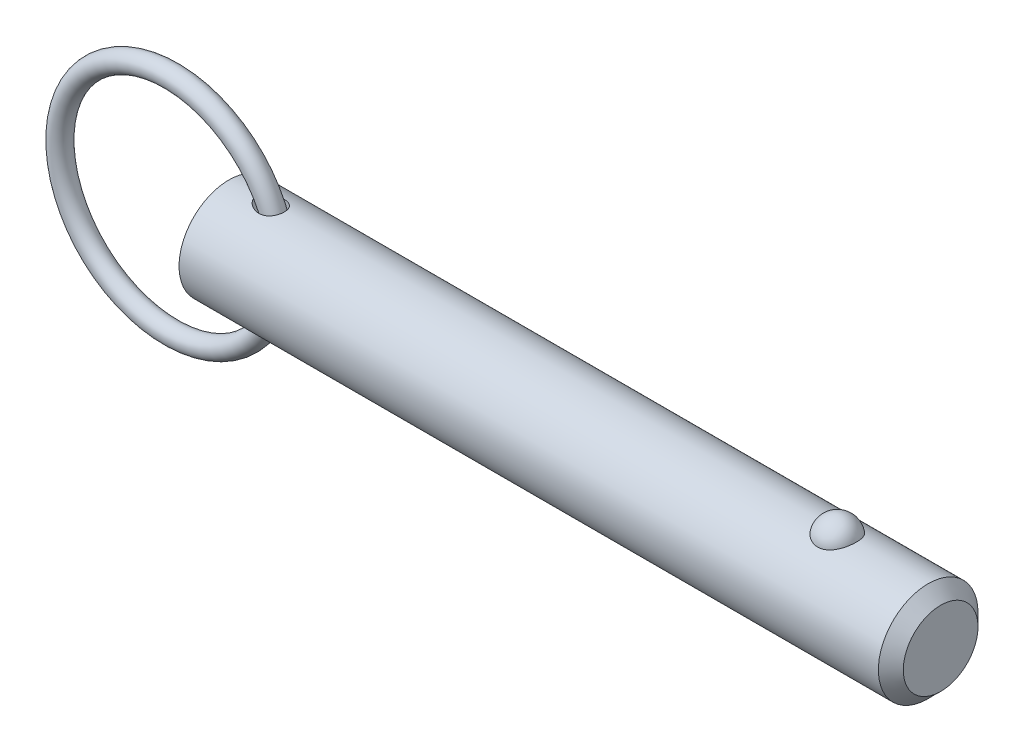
ISO-10303-21;
HEADER;
FILE_DESCRIPTION(('STEP AP214'),'2;1');
FILE_NAME('part.step','',(''),(''),'','','');
FILE_SCHEMA(('AUTOMOTIVE_DESIGN { 1 0 10303 214 1 1 1 1 }'));
ENDSEC;
DATA;
#1=APPLICATION_CONTEXT('core data for automotive mechanical design processes');
#2=APPLICATION_PROTOCOL_DEFINITION('international standard','automotive_design',2000,#1);
#3=PRODUCT_CONTEXT('',#1,'mechanical');
#4=PRODUCT('Part','Part','',(#3));
#5=PRODUCT_RELATED_PRODUCT_CATEGORY('part','',(#4));
#6=PRODUCT_DEFINITION_FORMATION('','',#4);
#7=PRODUCT_DEFINITION_CONTEXT('part definition',#1,'design');
#8=PRODUCT_DEFINITION('design','',#6,#7);
#9=PRODUCT_DEFINITION_SHAPE('','',#8);
#10=(LENGTH_UNIT() NAMED_UNIT(*) SI_UNIT(.MILLI.,.METRE.));
#11=(NAMED_UNIT(*) PLANE_ANGLE_UNIT() SI_UNIT($,.RADIAN.));
#12=(NAMED_UNIT(*) SI_UNIT($,.STERADIAN.) SOLID_ANGLE_UNIT());
#13=UNCERTAINTY_MEASURE_WITH_UNIT(LENGTH_MEASURE(1.E-05),#10,'distance_accuracy_value','');
#14=(GEOMETRIC_REPRESENTATION_CONTEXT(3) GLOBAL_UNCERTAINTY_ASSIGNED_CONTEXT((#13)) GLOBAL_UNIT_ASSIGNED_CONTEXT((#10,
#11,#12)) REPRESENTATION_CONTEXT('',''));
#15=CARTESIAN_POINT('',(0.,0.,0.));
#16=DIRECTION('',(0.,0.,1.));
#17=DIRECTION('',(1.,0.,0.));
#18=AXIS2_PLACEMENT_3D('',#15,#16,#17);
#19=CARTESIAN_POINT('',(-8.23730968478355,0.,0.));
#20=DIRECTION('',(0.,0.,1.));
#21=DIRECTION('',(1.,0.,0.));
#22=AXIS2_PLACEMENT_3D('',#19,#20,#21);
#23=TOROIDAL_SURFACE('',#22,15.875,1.422);
#24=CARTESIAN_POINT('',(9.05969031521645,0.,0.));
#25=VERTEX_POINT('',#24);
#26=VERTEX_LOOP('',#25);
#27=FACE_BOUND('',#26,.T.);
#28=ADVANCED_FACE('P0_F12',(#27),#23,.T.);
#29=CLOSED_SHELL('',(#28));
#30=MANIFOLD_SOLID_BREP('P0_B1',#29);
#31=CARTESIAN_POINT('',(0.,0.,0.));
#32=DIRECTION('',(1.,0.,0.));
#33=DIRECTION('',(0.,0.,-1.));
#34=AXIS2_PLACEMENT_3D('',#31,#32,#33);
#35=CYLINDRICAL_SURFACE('',#34,7.11);
#36=CARTESIAN_POINT('',(3.98467340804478,7.10072679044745,-0.363013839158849));
#37=CARTESIAN_POINT('',(4.00971652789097,7.09600153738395,-0.45539194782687));
#38=CARTESIAN_POINT('',(4.04401947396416,7.08958406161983,-0.545230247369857));
#39=CARTESIAN_POINT('',(4.12810160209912,7.07427055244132,-0.717157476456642));
#40=CARTESIAN_POINT('',(4.17791765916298,7.06536861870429,-0.799227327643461));
#41=CARTESIAN_POINT('',(4.28924471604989,7.04620300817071,-0.953469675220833));
#42=CARTESIAN_POINT('',(4.35063580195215,7.035953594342,-1.02573162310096));
#43=CARTESIAN_POINT('',(4.48282610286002,7.01493313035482,-1.16081412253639));
#44=CARTESIAN_POINT('',(4.55362244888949,7.00416223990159,-1.22363754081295));
#45=CARTESIAN_POINT('',(4.71659336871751,6.98090398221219,-1.35055080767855));
#46=CARTESIAN_POINT('',(4.81029272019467,6.96847103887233,-1.41269256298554));
#47=CARTESIAN_POINT('',(5.0057240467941,6.94515366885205,-1.52319699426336));
#48=CARTESIAN_POINT('',(5.10746392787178,6.93427079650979,-1.57154588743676));
#49=CARTESIAN_POINT('',(5.33503739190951,6.91346066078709,-1.66091325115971));
#50=CARTESIAN_POINT('',(5.46199550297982,6.90402388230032,-1.69921932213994));
#51=CARTESIAN_POINT('',(5.72084799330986,6.89024030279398,-1.75428261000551));
#52=CARTESIAN_POINT('',(5.85274301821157,6.88589416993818,-1.77103699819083));
#53=CARTESIAN_POINT('',(6.11557710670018,6.88337277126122,-1.78081990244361));
#54=CARTESIAN_POINT('',(6.24650031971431,6.88510489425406,-1.77420448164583));
#55=CARTESIAN_POINT('',(6.50446311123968,6.89478744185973,-1.73620392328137));
#56=CARTESIAN_POINT('',(6.6315075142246,6.90272978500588,-1.70485097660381));
#57=CARTESIAN_POINT('',(6.85933269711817,6.92243075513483,-1.62281888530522));
#58=CARTESIAN_POINT('',(6.96133251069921,6.93352131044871,-1.5753580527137));
#59=CARTESIAN_POINT('',(7.15436649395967,6.95824811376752,-1.46226310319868));
#60=CARTESIAN_POINT('',(7.24540699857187,6.97188287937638,-1.3966395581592));
#61=CARTESIAN_POINT('',(7.40446019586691,6.99838217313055,-1.25668991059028));
#62=CARTESIAN_POINT('',(7.473875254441,7.01118308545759,-1.18393777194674));
#63=CARTESIAN_POINT('',(7.59904891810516,7.03582803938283,-1.02736918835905));
#64=CARTESIAN_POINT('',(7.65481029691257,7.04767227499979,-0.943554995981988));
#65=CARTESIAN_POINT('',(7.74982438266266,7.06873077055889,-0.76979592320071));
#66=CARTESIAN_POINT('',(7.7894903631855,7.07800861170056,-0.680084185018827));
#67=CARTESIAN_POINT('',(7.85354088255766,7.09334756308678,-0.495102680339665));
#68=CARTESIAN_POINT('',(7.87792559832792,7.09940871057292,-0.399832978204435));
#69=CARTESIAN_POINT('',(7.9108898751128,7.10766731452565,-0.206294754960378));
#70=CARTESIAN_POINT('',(7.91944662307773,7.10985919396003,-0.108022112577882));
#71=CARTESIAN_POINT('',(7.920501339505,7.11012756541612,0.0886168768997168));
#72=CARTESIAN_POINT('',(7.91299895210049,7.10820396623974,0.186983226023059));
#73=CARTESIAN_POINT('',(7.88205794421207,7.10043733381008,0.381270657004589));
#74=CARTESIAN_POINT('',(7.85857985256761,7.09458459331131,0.477185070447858));
#75=CARTESIAN_POINT('',(7.79617406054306,7.07958431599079,0.663575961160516));
#76=CARTESIAN_POINT('',(7.75724672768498,7.07043685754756,0.754052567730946));
#77=CARTESIAN_POINT('',(7.66496731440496,7.04987259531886,0.926798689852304));
#78=CARTESIAN_POINT('',(7.61164530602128,7.0384605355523,1.00908483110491));
#79=CARTESIAN_POINT('',(7.49191707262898,7.01461776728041,1.16333092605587));
#80=CARTESIAN_POINT('',(7.42551210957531,7.00218715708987,1.235291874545));
#81=CARTESIAN_POINT('',(7.28164031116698,6.97770944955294,1.36680167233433));
#82=CARTESIAN_POINT('',(7.20420170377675,6.96566146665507,1.42638126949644));
#83=CARTESIAN_POINT('',(7.0403906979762,6.94319963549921,1.53199377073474));
#84=CARTESIAN_POINT('',(6.95401827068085,6.93278579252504,1.57802663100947));
#85=CARTESIAN_POINT('',(6.7731858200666,6.91444459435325,1.65656940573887));
#86=CARTESIAN_POINT('',(6.67860569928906,6.90656682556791,1.68881327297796));
#87=CARTESIAN_POINT('',(6.48544119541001,6.89422806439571,1.73849768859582));
#88=CARTESIAN_POINT('',(6.38685561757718,6.88976809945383,1.755933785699));
#89=CARTESIAN_POINT('',(6.18089829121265,6.88429907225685,1.77726234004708));
#90=CARTESIAN_POINT('',(6.07340937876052,6.88356485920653,1.78007646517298));
#91=CARTESIAN_POINT('',(5.85921220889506,6.886086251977,1.77029087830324));
#92=CARTESIAN_POINT('',(5.75250426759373,6.88934339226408,1.75768523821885));
#93=CARTESIAN_POINT('',(5.52848027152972,6.89994454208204,1.71563399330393));
#94=CARTESIAN_POINT('',(5.41155168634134,6.90775772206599,1.68424184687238));
#95=CARTESIAN_POINT('',(5.18376466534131,6.92670168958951,1.60454711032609));
#96=CARTESIAN_POINT('',(5.07291446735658,6.9378368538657,1.5562221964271));
#97=CARTESIAN_POINT('',(4.84835244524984,6.96347168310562,1.43744827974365));
#98=CARTESIAN_POINT('',(4.73562531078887,6.97820486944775,1.36517310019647));
#99=CARTESIAN_POINT('',(4.52504912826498,7.00822340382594,1.20158053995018));
#100=CARTESIAN_POINT('',(4.42717478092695,7.02350775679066,1.11029618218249));
#101=CARTESIAN_POINT('',(4.27935716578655,7.04784659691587,0.940654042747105));
#102=CARTESIAN_POINT('',(4.2239722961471,7.05736064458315,0.867099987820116));
#103=CARTESIAN_POINT('',(4.12558347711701,7.07469854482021,0.711919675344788));
#104=CARTESIAN_POINT('',(4.08256922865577,7.0825238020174,0.630300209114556));
#105=CARTESIAN_POINT('',(4.01142860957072,7.09565978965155,0.459428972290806));
#106=CARTESIAN_POINT('',(3.98346043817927,7.10094374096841,0.370107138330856));
#107=CARTESIAN_POINT('',(3.95517285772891,7.1063173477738,0.233358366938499));
#108=CARTESIAN_POINT('',(3.94802115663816,7.1076831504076,0.187321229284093));
#109=CARTESIAN_POINT('',(3.93842121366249,7.10951900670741,0.0947476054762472));
#110=CARTESIAN_POINT('',(3.93597129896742,7.10998937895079,0.0482113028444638));
#111=CARTESIAN_POINT('',(3.93584361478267,7.11001358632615,-0.0598597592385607));
#112=CARTESIAN_POINT('',(3.9399538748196,7.10922402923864,-0.121405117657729));
#113=CARTESIAN_POINT('',(3.95632793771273,7.10609781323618,-0.243320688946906));
#114=CARTESIAN_POINT('',(3.96859135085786,7.10376122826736,-0.303690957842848));
#115=CARTESIAN_POINT('',(3.98467340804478,7.10072679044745,-0.363013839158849));
#116=B_SPLINE_CURVE_WITH_KNOTS('',3,(#36,#37,#38,#39,#40,#41,#42,#43,#44,#45,#46,#47,#48,#49,
#50,#51,#52,#53,#54,#55,#56,#57,#58,#59,#60,#61,#62,#63,#64,#65,#66,#67,#68,#69,#70,#71,#72,#73,
#74,#75,#76,#77,#78,#79,#80,#81,#82,#83,#84,#85,#86,#87,#88,#89,#90,#91,#92,#93,#94,#95,#96,#97,
#98,#99,#100,#101,#102,#103,#104,#105,#106,#107,#108,#109,#110,#111,#112,#113,#114,#115),
.UNSPECIFIED.,.T.,.F.,(4,2,2,2,2,2,2,2,2,2,2,2,2,2,2,2,2,2,2,2,2,2,2,2,2,2,2,2,2,2,2,2,2,2,2,2,
2,2,2,4),(0.,0.287206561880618,0.575101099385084,0.860162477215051,1.14513709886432,
1.48324846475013,1.82169652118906,2.21865672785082,2.6156690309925,3.00665870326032,
3.39714041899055,3.73437585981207,4.07141541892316,4.37402271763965,4.67656849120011,
4.97076150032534,5.26495110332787,5.55956439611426,5.85418421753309,6.14953461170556,
6.44487798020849,6.73960905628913,7.03431171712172,7.32827352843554,7.6222362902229,
7.9216396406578,8.22113296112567,8.54242840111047,8.86384740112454,9.22635035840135,
9.58933304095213,9.99153142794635,10.3930368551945,10.6697219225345,10.9461759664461,
11.2254825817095,11.3650959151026,11.5046595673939,11.6891051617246,11.8735419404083),.UNSPECIFIED.);
#117=CARTESIAN_POINT('',(3.98467340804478,7.10072679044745,-0.363013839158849));
#118=VERTEX_POINT('',#117);
#119=EDGE_CURVE('P1_E40',#118,#118,#116,.T.);
#120=ORIENTED_EDGE('',*,*,#119,.T.);
#121=EDGE_LOOP('',(#120));
#122=FACE_BOUND('',#121,.T.);
#123=CARTESIAN_POINT('',(99.7925,0.,0.));
#124=DIRECTION('',(1.,0.,0.));
#125=DIRECTION('',(0.,0.,-1.));
#126=AXIS2_PLACEMENT_3D('',#123,#124,#125);
#127=CIRCLE('',#126,7.11);
#128=CARTESIAN_POINT('',(99.7925,0.,-7.11));
#129=VERTEX_POINT('',#128);
#130=EDGE_CURVE('P1_E25',#129,#129,#127,.T.);
#131=ORIENTED_EDGE('',*,*,#130,.F.);
#132=EDGE_LOOP('',(#131));
#133=FACE_BOUND('',#132,.T.);
#134=CARTESIAN_POINT('',(0.,0.,0.));
#135=DIRECTION('',(1.,0.,0.));
#136=DIRECTION('',(0.,0.,-1.));
#137=AXIS2_PLACEMENT_3D('',#134,#135,#136);
#138=CIRCLE('',#137,7.11);
#139=CARTESIAN_POINT('',(0.,0.,-7.11));
#140=VERTEX_POINT('',#139);
#141=EDGE_CURVE('P1_E9',#140,#140,#138,.T.);
#142=ORIENTED_EDGE('',*,*,#141,.T.);
#143=EDGE_LOOP('',(#142));
#144=FACE_BOUND('',#143,.T.);
#145=CARTESIAN_POINT('',(86.829258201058,6.53646663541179,2.79762469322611));
#146=CARTESIAN_POINT('',(86.6844296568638,6.53647876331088,2.79761243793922));
#147=CARTESIAN_POINT('',(86.539368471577,6.54144531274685,2.78608115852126));
#148=CARTESIAN_POINT('',(86.2532920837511,6.56077791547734,2.74023282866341));
#149=CARTESIAN_POINT('',(86.1122884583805,6.57516852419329,2.70585624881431));
#150=CARTESIAN_POINT('',(85.8388833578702,6.61165072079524,2.61544042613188));
#151=CARTESIAN_POINT('',(85.7064602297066,6.63372195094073,2.55945840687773));
#152=CARTESIAN_POINT('',(85.4532337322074,6.68316012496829,2.42742958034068));
#153=CARTESIAN_POINT('',(85.3324254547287,6.71052481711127,2.35139129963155));
#154=CARTESIAN_POINT('',(85.1016372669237,6.76860821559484,2.17866150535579));
#155=CARTESIAN_POINT('',(84.9920857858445,6.79940242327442,2.08142342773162));
#156=CARTESIAN_POINT('',(84.7903340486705,6.86050242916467,1.87020907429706));
#157=CARTESIAN_POINT('',(84.6981390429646,6.89080807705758,1.75622775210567));
#158=CARTESIAN_POINT('',(84.5292547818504,6.94923069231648,1.50900646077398));
#159=CARTESIAN_POINT('',(84.4534289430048,6.97719213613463,1.37513873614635));
#160=CARTESIAN_POINT('',(84.3242063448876,7.02647251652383,1.09584817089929));
#161=CARTESIAN_POINT('',(84.2708109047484,7.04779106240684,0.950424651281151));
#162=CARTESIAN_POINT('',(84.1871019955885,7.08180248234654,0.650508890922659));
#163=CARTESIAN_POINT('',(84.1570253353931,7.09440672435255,0.495940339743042));
#164=CARTESIAN_POINT('',(84.121473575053,7.10935121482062,0.183515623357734));
#165=CARTESIAN_POINT('',(84.1159974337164,7.11169189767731,0.0256595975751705));
#166=CARTESIAN_POINT('',(84.129700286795,7.10589702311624,-0.287512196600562));
#167=CARTESIAN_POINT('',(84.1486823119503,7.0978451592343,-0.442838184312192));
#168=CARTESIAN_POINT('',(84.2105745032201,7.07221860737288,-0.747830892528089));
#169=CARTESIAN_POINT('',(84.2534850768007,7.05464375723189,-0.897497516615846));
#170=CARTESIAN_POINT('',(84.3624527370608,7.01171031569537,-1.18722864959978));
#171=CARTESIAN_POINT('',(84.4285458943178,6.98633960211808,-1.32727778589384));
#172=CARTESIAN_POINT('',(84.5825362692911,6.93042258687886,-1.59370324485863));
#173=CARTESIAN_POINT('',(84.6704355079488,6.89987580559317,-1.72007829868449));
#174=CARTESIAN_POINT('',(84.8669269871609,6.83659510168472,-1.95657345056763));
#175=CARTESIAN_POINT('',(84.9756640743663,6.80384697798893,-2.06656957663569));
#176=CARTESIAN_POINT('',(85.2109686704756,6.7400183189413,-2.26611005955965));
#177=CARTESIAN_POINT('',(85.3375350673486,6.70893767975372,-2.35565569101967));
#178=CARTESIAN_POINT('',(85.6028454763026,6.65264442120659,-2.51019726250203));
#179=CARTESIAN_POINT('',(85.7413230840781,6.62733449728,-2.57561395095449));
#180=CARTESIAN_POINT('',(86.0285194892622,6.58495995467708,-2.68211134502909));
#181=CARTESIAN_POINT('',(86.1772343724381,6.56789220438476,-2.72320129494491));
#182=CARTESIAN_POINT('',(86.4726268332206,6.54478663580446,-2.7782581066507));
#183=CARTESIAN_POINT('',(86.6190295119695,6.53823639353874,-2.79348727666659));
#184=CARTESIAN_POINT('',(86.9124700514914,6.53532718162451,-2.80028921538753));
#185=CARTESIAN_POINT('',(87.0595077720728,6.53896606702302,-2.79186696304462));
#186=CARTESIAN_POINT('',(87.3449210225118,6.55570357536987,-2.75232178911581));
#187=CARTESIAN_POINT('',(87.4834221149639,6.56848455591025,-2.7219607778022));
#188=CARTESIAN_POINT('',(87.7531142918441,6.60173528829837,-2.64028774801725));
#189=CARTESIAN_POINT('',(87.884304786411,6.62220565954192,-2.5889740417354));
#190=CARTESIAN_POINT('',(88.1388462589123,6.6691792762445,-2.46547820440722));
#191=CARTESIAN_POINT('',(88.2619691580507,6.69580233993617,-2.392872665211));
#192=CARTESIAN_POINT('',(88.4944418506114,6.75207041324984,-2.22915269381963));
#193=CARTESIAN_POINT('',(88.6037884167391,6.78171612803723,-2.13803393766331));
#194=CARTESIAN_POINT('',(88.811642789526,6.8426462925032,-1.93445592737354));
#195=CARTESIAN_POINT('',(88.9093178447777,6.87393748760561,-1.8211477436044));
#196=CARTESIAN_POINT('',(89.0850112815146,6.93345710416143,-1.57947787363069));
#197=CARTESIAN_POINT('',(89.1630261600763,6.96168497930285,-1.45111351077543));
#198=CARTESIAN_POINT('',(89.2999857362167,7.01307558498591,-1.17842708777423));
#199=CARTESIAN_POINT('',(89.3582588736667,7.03605262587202,-1.03373189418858));
#200=CARTESIAN_POINT('',(89.4510815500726,7.07340932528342,-0.735867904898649));
#201=CARTESIAN_POINT('',(89.4856311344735,7.08778900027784,-0.582699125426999));
#202=CARTESIAN_POINT('',(89.530274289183,7.10647639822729,-0.272420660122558));
#203=CARTESIAN_POINT('',(89.54039710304,7.11079616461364,-0.115315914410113));
#204=CARTESIAN_POINT('',(89.536061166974,7.10896059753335,0.198488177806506));
#205=CARTESIAN_POINT('',(89.5216031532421,7.10280557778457,0.355187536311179));
#206=CARTESIAN_POINT('',(89.4685727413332,7.08071500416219,0.662724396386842));
#207=CARTESIAN_POINT('',(89.4301505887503,7.06484039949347,0.813592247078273));
#208=CARTESIAN_POINT('',(89.330101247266,7.02495896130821,1.10629159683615));
#209=CARTESIAN_POINT('',(89.2684724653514,7.00095156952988,1.24812247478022));
#210=CARTESIAN_POINT('',(89.1227668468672,6.94706632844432,1.51976439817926));
#211=CARTESIAN_POINT('',(89.0385448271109,6.91715085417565,1.64949012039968));
#212=CARTESIAN_POINT('',(88.8495861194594,6.8547056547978,1.89231285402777));
#213=CARTESIAN_POINT('',(88.7448501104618,6.82217601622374,2.00541041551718));
#214=CARTESIAN_POINT('',(88.5171030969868,6.75805358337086,2.21190674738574));
#215=CARTESIAN_POINT('',(88.394082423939,6.72646129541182,2.30529503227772));
#216=CARTESIAN_POINT('',(88.1327347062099,6.66789520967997,2.46959908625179));
#217=CARTESIAN_POINT('',(87.9944019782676,6.64092313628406,2.54050647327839));
#218=CARTESIAN_POINT('',(87.7111828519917,6.5957258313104,2.65560045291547));
#219=CARTESIAN_POINT('',(87.5666660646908,6.57724013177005,2.70059539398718));
#220=CARTESIAN_POINT('',(87.2715469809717,6.55006426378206,2.76587321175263));
#221=CARTESIAN_POINT('',(87.1209640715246,6.54134511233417,2.78622922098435));
#222=CARTESIAN_POINT('',(86.9230463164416,6.53697847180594,2.79642434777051));
#223=CARTESIAN_POINT('',(86.8761644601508,6.53646270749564,2.7976286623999));
#224=CARTESIAN_POINT('',(86.829258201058,6.53646663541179,2.79762469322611));
#225=B_SPLINE_CURVE_WITH_KNOTS('',3,(#145,#146,#147,#148,#149,#150,#151,#152,#153,#154,#155,
#156,#157,#158,#159,#160,#161,#162,#163,#164,#165,#166,#167,#168,#169,#170,#171,#172,#173,#174,
#175,#176,#177,#178,#179,#180,#181,#182,#183,#184,#185,#186,#187,#188,#189,#190,#191,#192,#193,
#194,#195,#196,#197,#198,#199,#200,#201,#202,#203,#204,#205,#206,#207,#208,#209,#210,#211,#212,
#213,#214,#215,#216,#217,#218,#219,#220,#221,#222,#223,#224),.UNSPECIFIED.,.T.,.F.,(4,2,2,2,2,2,
2,2,2,2,2,2,2,2,2,2,2,2,2,2,2,2,2,2,2,2,2,2,2,2,2,2,2,2,2,2,2,2,2,4),(0.,0.434355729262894,
0.869847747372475,1.30419416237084,1.73835621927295,2.18541922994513,2.63261726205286,
3.09954261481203,3.56649542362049,4.03813031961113,4.50974525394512,4.97758575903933,
5.44543423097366,5.91401389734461,6.38263700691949,6.85464418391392,7.32662193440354,
7.7899297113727,8.25306131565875,8.69285754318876,9.13256119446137,9.55768625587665,
9.98284556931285,10.4171106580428,10.8514772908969,11.3079089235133,11.7644218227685,
12.2351898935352,12.7059570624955,13.1761603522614,13.6463495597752,14.1136200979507,
14.580922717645,15.0513032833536,15.5216682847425,15.9922828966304,16.4630727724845,
16.918245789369,17.372064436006,17.5127411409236),.UNSPECIFIED.);
#226=CARTESIAN_POINT('',(86.829258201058,6.53646663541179,2.79762469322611));
#227=VERTEX_POINT('',#226);
#228=EDGE_CURVE('P1_E34',#227,#227,#225,.T.);
#229=ORIENTED_EDGE('',*,*,#228,.T.);
#230=EDGE_LOOP('',(#229));
#231=FACE_BOUND('',#230,.T.);
#232=CARTESIAN_POINT('',(3.98467340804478,-7.10072679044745,-0.363013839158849));
#233=CARTESIAN_POINT('',(3.96426456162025,-7.10457733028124,-0.287714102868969));
#234=CARTESIAN_POINT('',(3.95000501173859,-7.10730349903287,-0.210695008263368));
#235=CARTESIAN_POINT('',(3.93481801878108,-7.11020840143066,-0.0553038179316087));
#236=CARTESIAN_POINT('',(3.93388435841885,-7.11038832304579,0.0230676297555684));
#237=CARTESIAN_POINT('',(3.94541910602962,-7.10817995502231,0.178714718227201));
#238=CARTESIAN_POINT('',(3.95787987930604,-7.10579312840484,0.25599095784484));
#239=CARTESIAN_POINT('',(3.99523775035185,-7.09872642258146,0.407352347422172));
#240=CARTESIAN_POINT('',(4.02014065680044,-7.09404547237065,0.481435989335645));
#241=CARTESIAN_POINT('',(4.08119600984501,-7.08278363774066,0.625775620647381));
#242=CARTESIAN_POINT('',(4.11749458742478,-7.07617815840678,0.695967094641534));
#243=CARTESIAN_POINT('',(4.19940836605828,-7.06165305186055,0.830508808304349));
#244=CARTESIAN_POINT('',(4.24502952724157,-7.0537325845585,0.894855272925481));
#245=CARTESIAN_POINT('',(4.36790232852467,-7.03310314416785,1.04688574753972));
#246=CARTESIAN_POINT('',(4.44977459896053,-7.01993229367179,1.13078695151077));
#247=CARTESIAN_POINT('',(4.62610796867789,-6.99351259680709,1.28411726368));
#248=CARTESIAN_POINT('',(4.7205898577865,-6.98026365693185,1.35352197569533));
#249=CARTESIAN_POINT('',(4.92036507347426,-6.9549104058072,1.47831921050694));
#250=CARTESIAN_POINT('',(5.02579054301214,-6.94282458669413,1.53350332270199));
#251=CARTESIAN_POINT('',(5.24378330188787,-6.92129098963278,1.62793610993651));
#252=CARTESIAN_POINT('',(5.35635066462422,-6.91184323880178,1.66718462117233));
#253=CARTESIAN_POINT('',(5.60134354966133,-6.89573491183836,1.73269893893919));
#254=CARTESIAN_POINT('',(5.73444697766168,-6.8895970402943,1.75661057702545));
#255=CARTESIAN_POINT('',(6.00300738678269,-6.88344616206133,1.78057487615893));
#256=CARTESIAN_POINT('',(6.13846360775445,-6.88343121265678,1.78063510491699));
#257=CARTESIAN_POINT('',(6.39660470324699,-6.88981379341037,1.75576480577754));
#258=CARTESIAN_POINT('',(6.51947843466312,-6.89572457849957,1.73273121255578));
#259=CARTESIAN_POINT('',(6.75813770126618,-6.91274434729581,1.66352936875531));
#260=CARTESIAN_POINT('',(6.87393155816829,-6.92384709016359,1.61738888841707));
#261=CARTESIAN_POINT('',(7.07801861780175,-6.94787316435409,1.51052664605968));
#262=CARTESIAN_POINT('',(7.16789841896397,-6.96033024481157,1.45271574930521));
#263=CARTESIAN_POINT('',(7.33546773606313,-6.98638661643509,1.32171912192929));
#264=CARTESIAN_POINT('',(7.41316182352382,-6.99998547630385,1.24853918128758));
#265=CARTESIAN_POINT('',(7.54861420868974,-7.02559503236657,1.09486170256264));
#266=CARTESIAN_POINT('',(7.60741145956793,-7.03764930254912,1.01528346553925));
#267=CARTESIAN_POINT('',(7.71070740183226,-7.0598657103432,0.847099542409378));
#268=CARTESIAN_POINT('',(7.75520788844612,-7.0700280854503,0.758494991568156));
#269=CARTESIAN_POINT('',(7.82836147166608,-7.08722075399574,0.575936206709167));
#270=CARTESIAN_POINT('',(7.85719783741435,-7.09428707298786,0.482058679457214));
#271=CARTESIAN_POINT('',(7.89918378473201,-7.10470260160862,0.29065874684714));
#272=CARTESIAN_POINT('',(7.91233308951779,-7.10805174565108,0.193136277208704));
#273=CARTESIAN_POINT('',(7.92267451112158,-7.11067890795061,-0.00313968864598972));
#274=CARTESIAN_POINT('',(7.91981203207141,-7.10994299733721,-0.10189624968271));
#275=CARTESIAN_POINT('',(7.89806489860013,-7.10444651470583,-0.297516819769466));
#276=CARTESIAN_POINT('',(7.87918005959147,-7.09968589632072,-0.394380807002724));
#277=CARTESIAN_POINT('',(7.82577988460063,-7.0866471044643,-0.58355375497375));
#278=CARTESIAN_POINT('',(7.79124976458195,-7.07836560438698,-0.675858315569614));
#279=CARTESIAN_POINT('',(7.70736343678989,-7.05919003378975,-0.853167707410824));
#280=CARTESIAN_POINT('',(7.65800801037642,-7.04829610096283,-0.938172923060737));
#281=CARTESIAN_POINT('',(7.54590141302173,-7.02513961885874,-1.09819812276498));
#282=CARTESIAN_POINT('',(7.48319521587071,-7.01288172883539,-1.17325029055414));
#283=CARTESIAN_POINT('',(7.34599775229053,-6.98832192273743,-1.31164333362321));
#284=CARTESIAN_POINT('',(7.27150757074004,-6.97602001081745,-1.37498528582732));
#285=CARTESIAN_POINT('',(7.11277776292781,-6.95268608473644,-1.48849974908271));
#286=CARTESIAN_POINT('',(7.02852525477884,-6.94165578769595,-1.53865456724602));
#287=CARTESIAN_POINT('',(6.85282430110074,-6.92200320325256,-1.62478650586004));
#288=CARTESIAN_POINT('',(6.76137511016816,-6.91338116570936,-1.66076215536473));
#289=CARTESIAN_POINT('',(6.57061179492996,-6.89906044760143,-1.71930563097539));
#290=CARTESIAN_POINT('',(6.47113516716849,-6.89347290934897,-1.74136795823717));
#291=CARTESIAN_POINT('',(6.26989833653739,-6.88605020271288,-1.7704895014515));
#292=CARTESIAN_POINT('',(6.16813737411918,-6.88421630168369,-1.77754365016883));
#293=CARTESIAN_POINT('',(5.95492537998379,-6.88424071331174,-1.77745174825));
#294=CARTESIAN_POINT('',(5.8434768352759,-6.88646827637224,-1.76888555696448));
#295=CARTESIAN_POINT('',(5.62307560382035,-6.89483827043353,-1.73596677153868));
#296=CARTESIAN_POINT('',(5.51412477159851,-6.90098351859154,-1.71160281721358));
#297=CARTESIAN_POINT('',(5.28644478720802,-6.91743803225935,-1.64393691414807));
#298=CARTESIAN_POINT('',(5.16837217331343,-6.92819628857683,-1.59852806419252));
#299=CARTESIAN_POINT('',(4.94091825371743,-6.95234836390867,-1.4899796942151));
#300=CARTESIAN_POINT('',(4.83153887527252,-6.96574276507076,-1.42683625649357));
#301=CARTESIAN_POINT('',(4.63576710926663,-6.99209234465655,-1.29112257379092));
#302=CARTESIAN_POINT('',(4.54816728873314,-7.00494184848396,-1.22027748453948));
#303=CARTESIAN_POINT('',(4.38554897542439,-7.03019055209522,-1.0652111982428));
#304=CARTESIAN_POINT('',(4.31052141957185,-7.04259007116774,-0.980999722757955));
#305=CARTESIAN_POINT('',(4.18551811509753,-7.0640229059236,-0.811206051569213));
#306=CARTESIAN_POINT('',(4.13358417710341,-7.07328321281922,-0.727107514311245));
#307=CARTESIAN_POINT('',(4.04607461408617,-7.0891994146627,-0.550580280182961));
#308=CARTESIAN_POINT('',(4.01046401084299,-7.09586087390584,-0.458169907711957));
#309=CARTESIAN_POINT('',(3.98467340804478,-7.10072679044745,-0.363013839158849));
#310=B_SPLINE_CURVE_WITH_KNOTS('',3,(#232,#233,#234,#235,#236,#237,#238,#239,#240,#241,#242,
#243,#244,#245,#246,#247,#248,#249,#250,#251,#252,#253,#254,#255,#256,#257,#258,#259,#260,#261,
#262,#263,#264,#265,#266,#267,#268,#269,#270,#271,#272,#273,#274,#275,#276,#277,#278,#279,#280,
#281,#282,#283,#284,#285,#286,#287,#288,#289,#290,#291,#292,#293,#294,#295,#296,#297,#298,#299,
#300,#301,#302,#303,#304,#305,#306,#307,#308,#309),.UNSPECIFIED.,.T.,.F.,(4,2,2,2,2,2,2,2,2,2,2,
2,2,2,2,2,2,2,2,2,2,2,2,2,2,2,2,2,2,2,2,2,2,2,2,2,2,2,4),(0.,0.23402065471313,0.467932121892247,
0.701710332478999,0.935597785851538,1.17261620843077,1.40978663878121,1.76177576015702,
2.11435255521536,2.47183528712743,2.8293216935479,3.23332937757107,3.63720887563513,
4.01042610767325,4.38319587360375,4.70425151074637,5.02518641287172,5.32277979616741,
5.62033579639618,5.91433101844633,6.2083314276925,6.50333490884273,6.79834178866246,
7.09362801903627,7.38889868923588,7.6831900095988,7.9774542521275,8.27211131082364,
8.56679892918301,8.8716552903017,9.17661456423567,9.51069129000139,9.84500851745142,
10.2243046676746,10.6036846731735,10.9425776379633,11.2812252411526,11.5775945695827,
11.8733258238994),.UNSPECIFIED.);
#311=CARTESIAN_POINT('',(3.98467340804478,-7.10072679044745,-0.363013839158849));
#312=VERTEX_POINT('',#311);
#313=EDGE_CURVE('P1_E17',#312,#312,#310,.T.);
#314=ORIENTED_EDGE('',*,*,#313,.T.);
#315=EDGE_LOOP('',(#314));
#316=FACE_BOUND('',#315,.T.);
#317=ADVANCED_FACE('P1_F13',(#122,#133,#144,#231,#316),#35,.T.);
#318=CARTESIAN_POINT('',(0.,0.,0.));
#319=DIRECTION('',(-1.,0.,0.));
#320=DIRECTION('',(0.,0.,1.));
#321=AXIS2_PLACEMENT_3D('',#318,#319,#320);
#322=PLANE('',#321);
#323=ORIENTED_EDGE('',*,*,#141,.F.);
#324=EDGE_LOOP('',(#323));
#325=FACE_BOUND('',#324,.T.);
#326=ADVANCED_FACE('P1_F15',(#325),#322,.T.);
#327=CARTESIAN_POINT('',(101.57,0.,0.));
#328=DIRECTION('',(-1.,0.,0.));
#329=DIRECTION('',(0.,0.,1.));
#330=AXIS2_PLACEMENT_3D('',#327,#328,#329);
#331=CONICAL_SURFACE('',#330,5.33250000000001,0.785398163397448);
#332=ORIENTED_EDGE('',*,*,#130,.T.);
#333=EDGE_LOOP('',(#332));
#334=FACE_BOUND('',#333,.T.);
#335=CARTESIAN_POINT('',(101.57,0.,0.));
#336=DIRECTION('',(1.,0.,0.));
#337=DIRECTION('',(0.,0.,-1.));
#338=AXIS2_PLACEMENT_3D('',#335,#336,#337);
#339=CIRCLE('',#338,5.33250000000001);
#340=CARTESIAN_POINT('',(101.57,0.,-5.33250000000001));
#341=VERTEX_POINT('',#340);
#342=EDGE_CURVE('P1_E30',#341,#341,#339,.T.);
#343=ORIENTED_EDGE('',*,*,#342,.F.);
#344=EDGE_LOOP('',(#343));
#345=FACE_BOUND('',#344,.T.);
#346=ADVANCED_FACE('P1_F55',(#334,#345),#331,.T.);
#347=CARTESIAN_POINT('',(101.57,5.33250000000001,0.));
#348=DIRECTION('',(1.,0.,0.));
#349=DIRECTION('',(0.,0.,-1.));
#350=AXIS2_PLACEMENT_3D('',#347,#348,#349);
#351=PLANE('',#350);
#352=ORIENTED_EDGE('',*,*,#342,.T.);
#353=EDGE_LOOP('',(#352));
#354=FACE_BOUND('',#353,.T.);
#355=ADVANCED_FACE('P1_F51',(#354),#351,.T.);
#356=CARTESIAN_POINT('',(86.829258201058,6.399,0.));
#357=DIRECTION('',(-1.,0.,0.));
#358=DIRECTION('',(0.,1.,0.));
#359=AXIS2_PLACEMENT_3D('',#356,#357,#358);
#360=SPHERICAL_SURFACE('',#359,2.80099999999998);
#361=ORIENTED_EDGE('',*,*,#228,.F.);
#362=EDGE_LOOP('',(#361));
#363=FACE_BOUND('',#362,.T.);
#364=ADVANCED_FACE('P1_F46',(#363),#360,.T.);
#365=CARTESIAN_POINT('',(-8.23730968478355,0.,0.));
#366=DIRECTION('',(0.,0.,1.));
#367=DIRECTION('',(1.,0.,0.));
#368=AXIS2_PLACEMENT_3D('',#365,#366,#367);
#369=TOROIDAL_SURFACE('',#368,15.875,1.7775);
#370=ORIENTED_EDGE('',*,*,#313,.F.);
#371=EDGE_LOOP('',(#370));
#372=FACE_BOUND('',#371,.T.);
#373=ORIENTED_EDGE('',*,*,#119,.F.);
#374=EDGE_LOOP('',(#373));
#375=FACE_BOUND('',#374,.T.);
#376=ADVANCED_FACE('P1_F50',(#372,#375),#369,.F.);
#377=CLOSED_SHELL('',(#317,#326,#346,#355,#364,#376));
#378=MANIFOLD_SOLID_BREP('P1_B1',#377);
#379=ADVANCED_BREP_SHAPE_REPRESENTATION('',(#18,#30,#378),#14);
#380=SHAPE_DEFINITION_REPRESENTATION(#9,#379);
ENDSEC;
END-ISO-10303-21;
